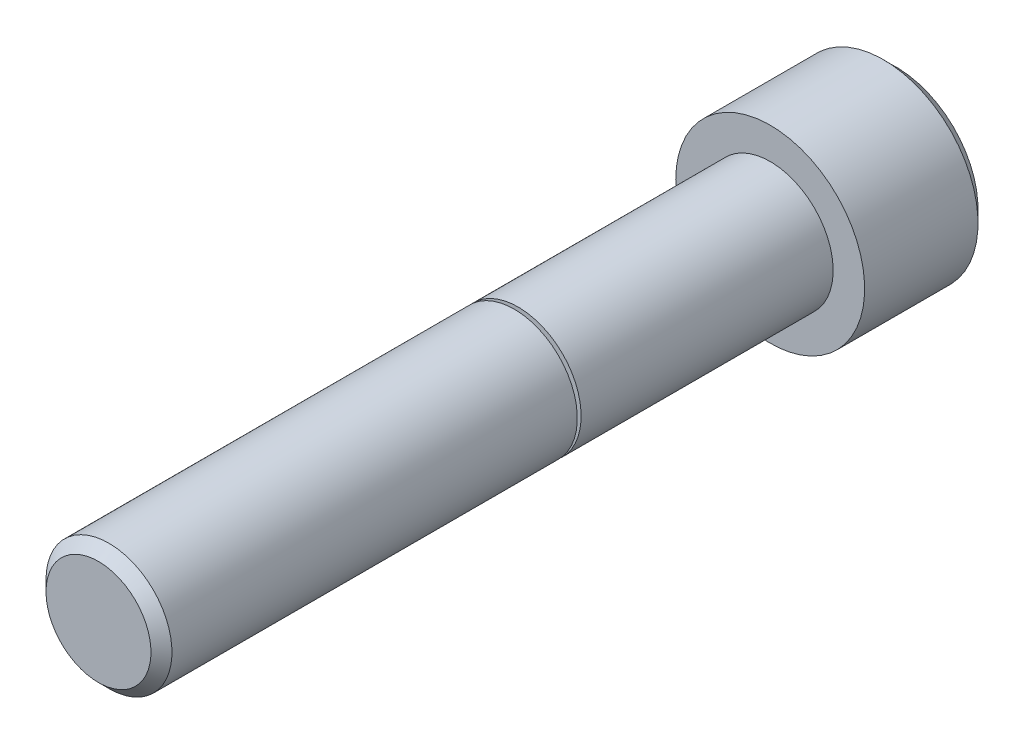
ISO-10303-21;
HEADER;
FILE_DESCRIPTION(('STEP AP214'),'2;1');
FILE_NAME('part.step','',(''),(''),'','','');
FILE_SCHEMA(('AUTOMOTIVE_DESIGN { 1 0 10303 214 1 1 1 1 }'));
ENDSEC;
DATA;
#1=APPLICATION_CONTEXT('core data for automotive mechanical design processes');
#2=APPLICATION_PROTOCOL_DEFINITION('international standard','automotive_design',2000,#1);
#3=PRODUCT_CONTEXT('',#1,'mechanical');
#4=PRODUCT('Part','Part','',(#3));
#5=PRODUCT_RELATED_PRODUCT_CATEGORY('part','',(#4));
#6=PRODUCT_DEFINITION_FORMATION('','',#4);
#7=PRODUCT_DEFINITION_CONTEXT('part definition',#1,'design');
#8=PRODUCT_DEFINITION('design','',#6,#7);
#9=PRODUCT_DEFINITION_SHAPE('','',#8);
#10=(LENGTH_UNIT() NAMED_UNIT(*) SI_UNIT(.MILLI.,.METRE.));
#11=(NAMED_UNIT(*) PLANE_ANGLE_UNIT() SI_UNIT($,.RADIAN.));
#12=(NAMED_UNIT(*) SI_UNIT($,.STERADIAN.) SOLID_ANGLE_UNIT());
#13=UNCERTAINTY_MEASURE_WITH_UNIT(LENGTH_MEASURE(1.E-05),#10,'distance_accuracy_value','');
#14=(GEOMETRIC_REPRESENTATION_CONTEXT(3) GLOBAL_UNCERTAINTY_ASSIGNED_CONTEXT((#13)) GLOBAL_UNIT_ASSIGNED_CONTEXT((#10,
#11,#12)) REPRESENTATION_CONTEXT('',''));
#15=CARTESIAN_POINT('',(0.,0.,0.));
#16=DIRECTION('',(0.,0.,1.));
#17=DIRECTION('',(1.,0.,0.));
#18=AXIS2_PLACEMENT_3D('',#15,#16,#17);
#19=CARTESIAN_POINT('',(0.,0.,-9.52499999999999));
#20=DIRECTION('',(0.,0.,1.));
#21=DIRECTION('',(1.,0.,0.));
#22=AXIS2_PLACEMENT_3D('',#19,#20,#21);
#23=PLANE('',#22);
#24=DIRECTION('',(-0.5,-0.866025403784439,0.));
#25=VECTOR('',#24,1.);
#26=CARTESIAN_POINT('',(4.57538541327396,0.,-9.52499999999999));
#27=LINE('',#26,#25);
#28=CARTESIAN_POINT('',(4.57538541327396,0.,-9.52499999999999));
#29=VERTEX_POINT('',#28);
#30=CARTESIAN_POINT('',(2.28769270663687,-3.96240000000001,-9.52499999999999));
#31=VERTEX_POINT('',#30);
#32=EDGE_CURVE('E145',#29,#31,#27,.T.);
#33=ORIENTED_EDGE('',*,*,#32,.F.);
#34=DIRECTION('',(0.499999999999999,-0.866025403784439,0.));
#35=VECTOR('',#34,1.);
#36=CARTESIAN_POINT('',(2.28769270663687,3.96240000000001,-9.52499999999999));
#37=LINE('',#36,#35);
#38=CARTESIAN_POINT('',(2.28769270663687,3.96240000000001,-9.52499999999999));
#39=VERTEX_POINT('',#38);
#40=EDGE_CURVE('E64',#39,#29,#37,.T.);
#41=ORIENTED_EDGE('',*,*,#40,.F.);
#42=DIRECTION('',(1.,0.,0.));
#43=VECTOR('',#42,1.);
#44=CARTESIAN_POINT('',(-2.28769270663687,3.96240000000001,-9.52499999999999));
#45=LINE('',#44,#43);
#46=CARTESIAN_POINT('',(-2.28769270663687,3.96240000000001,-9.52499999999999));
#47=VERTEX_POINT('',#46);
#48=EDGE_CURVE('E158',#47,#39,#45,.T.);
#49=ORIENTED_EDGE('',*,*,#48,.F.);
#50=DIRECTION('',(0.5,0.866025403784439,0.));
#51=VECTOR('',#50,1.);
#52=CARTESIAN_POINT('',(-4.57538541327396,0.,-9.52499999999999));
#53=LINE('',#52,#51);
#54=CARTESIAN_POINT('',(-4.57538541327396,0.,-9.52499999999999));
#55=VERTEX_POINT('',#54);
#56=EDGE_CURVE('E155',#55,#47,#53,.T.);
#57=ORIENTED_EDGE('',*,*,#56,.F.);
#58=DIRECTION('',(-0.5,0.866025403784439,0.));
#59=VECTOR('',#58,1.);
#60=CARTESIAN_POINT('',(-2.28769270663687,-3.96240000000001,-9.52499999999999));
#61=LINE('',#60,#59);
#62=CARTESIAN_POINT('',(-2.28769270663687,-3.96240000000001,-9.52499999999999));
#63=VERTEX_POINT('',#62);
#64=EDGE_CURVE('E112',#63,#55,#61,.T.);
#65=ORIENTED_EDGE('',*,*,#64,.F.);
#66=DIRECTION('',(-1.,0.,0.));
#67=VECTOR('',#66,1.);
#68=CARTESIAN_POINT('',(2.28769270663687,-3.96240000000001,-9.52499999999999));
#69=LINE('',#68,#67);
#70=EDGE_CURVE('E149',#31,#63,#69,.T.);
#71=ORIENTED_EDGE('',*,*,#70,.F.);
#72=EDGE_LOOP('',(#33,#41,#49,#57,#65,#71));
#73=FACE_BOUND('',#72,.T.);
#74=CARTESIAN_POINT('',(0.,0.,-9.52499999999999));
#75=DIRECTION('',(0.,0.,-1.));
#76=DIRECTION('',(-1.,0.,0.));
#77=AXIS2_PLACEMENT_3D('',#74,#75,#76);
#78=CIRCLE('',#77,6.19125000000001);
#79=CARTESIAN_POINT('',(-6.19125000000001,0.,-9.52499999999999));
#80=VERTEX_POINT('',#79);
#81=EDGE_CURVE('E164',#80,#80,#78,.T.);
#82=ORIENTED_EDGE('',*,*,#81,.T.);
#83=EDGE_LOOP('',(#82));
#84=FACE_BOUND('',#83,.T.);
#85=ADVANCED_FACE('F49',(#73,#84),#23,.F.);
#86=CARTESIAN_POINT('',(-3.96875000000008,0.,50.8));
#87=DIRECTION('',(0.,0.,-1.));
#88=DIRECTION('',(-1.,0.,0.));
#89=AXIS2_PLACEMENT_3D('',#86,#87,#88);
#90=PLANE('',#89);
#91=CARTESIAN_POINT('',(0.,0.,50.8));
#92=DIRECTION('',(0.,0.,-1.));
#93=DIRECTION('',(-1.,0.,0.));
#94=AXIS2_PLACEMENT_3D('',#91,#92,#93);
#95=CIRCLE('',#94,3.96875000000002);
#96=CARTESIAN_POINT('',(-3.96875000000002,0.,50.8));
#97=VERTEX_POINT('',#96);
#98=EDGE_CURVE('E11',#97,#97,#95,.T.);
#99=ORIENTED_EDGE('',*,*,#98,.F.);
#100=EDGE_LOOP('',(#99));
#101=FACE_BOUND('',#100,.T.);
#102=ADVANCED_FACE('F214',(#101),#90,.F.);
#103=CARTESIAN_POINT('',(0.,0.,50.8));
#104=DIRECTION('',(0.,0.,-1.));
#105=DIRECTION('',(-1.,0.,0.));
#106=AXIS2_PLACEMENT_3D('',#103,#104,#105);
#107=CONICAL_SURFACE('',#106,3.96875000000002,0.785398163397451);
#108=CARTESIAN_POINT('',(0.,0.,50.00625));
#109=DIRECTION('',(0.,0.,-1.));
#110=DIRECTION('',(-1.,0.,0.));
#111=AXIS2_PLACEMENT_3D('',#108,#109,#110);
#112=CIRCLE('',#111,4.76250000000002);
#113=CARTESIAN_POINT('',(-4.76250000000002,0.,50.00625));
#114=VERTEX_POINT('',#113);
#115=EDGE_CURVE('E57',#114,#114,#112,.T.);
#116=ORIENTED_EDGE('',*,*,#115,.F.);
#117=EDGE_LOOP('',(#116));
#118=FACE_BOUND('',#117,.T.);
#119=ORIENTED_EDGE('',*,*,#98,.T.);
#120=EDGE_LOOP('',(#119));
#121=FACE_BOUND('',#120,.T.);
#122=ADVANCED_FACE('F211',(#118,#121),#107,.T.);
#123=CARTESIAN_POINT('',(0.,0.,-10.585154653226));
#124=DIRECTION('',(0.,0.,-1.));
#125=DIRECTION('',(-1.,0.,0.));
#126=AXIS2_PLACEMENT_3D('',#123,#124,#125);
#127=CYLINDRICAL_SURFACE('',#126,4.76250000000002);
#128=CARTESIAN_POINT('',(0.,0.,19.3489013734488));
#129=DIRECTION('',(0.,0.,-1.));
#130=DIRECTION('',(-1.,0.,0.));
#131=AXIS2_PLACEMENT_3D('',#128,#129,#130);
#132=CIRCLE('',#131,4.76250000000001);
#133=CARTESIAN_POINT('',(-4.76250000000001,0.,19.3489013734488));
#134=VERTEX_POINT('',#133);
#135=EDGE_CURVE('E201',#134,#134,#132,.T.);
#136=ORIENTED_EDGE('',*,*,#135,.F.);
#137=EDGE_LOOP('',(#136));
#138=FACE_BOUND('',#137,.T.);
#139=ORIENTED_EDGE('',*,*,#115,.T.);
#140=EDGE_LOOP('',(#139));
#141=FACE_BOUND('',#140,.T.);
#142=ADVANCED_FACE('F209',(#138,#141),#127,.T.);
#143=CARTESIAN_POINT('',(0.,0.,19.3489013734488));
#144=DIRECTION('',(0.,0.,1.));
#145=DIRECTION('',(1.,0.,0.));
#146=AXIS2_PLACEMENT_3D('',#143,#144,#145);
#147=CONICAL_SURFACE('',#146,4.76250000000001,1.22173047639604);
#148=CARTESIAN_POINT('',(0.,0.,19.0987938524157));
#149=DIRECTION('',(0.,0.,-1.));
#150=DIRECTION('',(-1.,0.,0.));
#151=AXIS2_PLACEMENT_3D('',#148,#149,#150);
#152=CIRCLE('',#151,4.07533523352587);
#153=CARTESIAN_POINT('',(-4.07533523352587,0.,19.0987938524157));
#154=VERTEX_POINT('',#153);
#155=EDGE_CURVE('E197',#154,#154,#152,.T.);
#156=ORIENTED_EDGE('',*,*,#155,.F.);
#157=EDGE_LOOP('',(#156));
#158=FACE_BOUND('',#157,.T.);
#159=ORIENTED_EDGE('',*,*,#135,.T.);
#160=EDGE_LOOP('',(#159));
#161=FACE_BOUND('',#160,.T.);
#162=ADVANCED_FACE('F226',(#158,#161),#147,.T.);
#163=CARTESIAN_POINT('',(0.,0.,19.08));
#164=DIRECTION('',(0.,0.,-1.));
#165=DIRECTION('',(-1.,0.,0.));
#166=AXIS2_PLACEMENT_3D('',#163,#164,#165);
#167=TOROIDAL_SURFACE('',#166,4.08217563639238,0.0199999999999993);
#168=CARTESIAN_POINT('',(0.,0.,19.06));
#169=DIRECTION('',(0.,0.,-1.));
#170=DIRECTION('',(-1.,0.,0.));
#171=AXIS2_PLACEMENT_3D('',#168,#169,#170);
#172=CIRCLE('',#171,4.08217563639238);
#173=CARTESIAN_POINT('',(-4.08217563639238,0.,19.06));
#174=VERTEX_POINT('',#173);
#175=EDGE_CURVE('E193',#174,#174,#172,.T.);
#176=ORIENTED_EDGE('',*,*,#175,.F.);
#177=EDGE_LOOP('',(#176));
#178=FACE_BOUND('',#177,.T.);
#179=ORIENTED_EDGE('',*,*,#155,.T.);
#180=EDGE_LOOP('',(#179));
#181=FACE_BOUND('',#180,.T.);
#182=ADVANCED_FACE('F230',(#178,#181),#167,.F.);
#183=CARTESIAN_POINT('',(-4.7625,0.,19.06));
#184=DIRECTION('',(0.,0.,-1.));
#185=DIRECTION('',(-1.,0.,0.));
#186=AXIS2_PLACEMENT_3D('',#183,#184,#185);
#187=PLANE('',#186);
#188=CARTESIAN_POINT('',(0.,0.,19.06));
#189=DIRECTION('',(0.,0.,-1.));
#190=DIRECTION('',(-1.,0.,0.));
#191=AXIS2_PLACEMENT_3D('',#188,#189,#190);
#192=CIRCLE('',#191,4.76250000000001);
#193=CARTESIAN_POINT('',(-4.76250000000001,0.,19.06));
#194=VERTEX_POINT('',#193);
#195=EDGE_CURVE('E189',#194,#194,#192,.T.);
#196=ORIENTED_EDGE('',*,*,#195,.F.);
#197=EDGE_LOOP('',(#196));
#198=FACE_BOUND('',#197,.T.);
#199=ORIENTED_EDGE('',*,*,#175,.T.);
#200=EDGE_LOOP('',(#199));
#201=FACE_BOUND('',#200,.T.);
#202=ADVANCED_FACE('F234',(#198,#201),#187,.F.);
#203=CARTESIAN_POINT('',(0.,0.,-10.585154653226));
#204=DIRECTION('',(0.,0.,-1.));
#205=DIRECTION('',(-1.,0.,0.));
#206=AXIS2_PLACEMENT_3D('',#203,#204,#205);
#207=CYLINDRICAL_SURFACE('',#206,4.76250000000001);
#208=CARTESIAN_POINT('',(0.,0.,0.));
#209=DIRECTION('',(0.,0.,-1.));
#210=DIRECTION('',(-1.,0.,0.));
#211=AXIS2_PLACEMENT_3D('',#208,#209,#210);
#212=CIRCLE('',#211,4.7625);
#213=CARTESIAN_POINT('',(-4.7625,0.,0.));
#214=VERTEX_POINT('',#213);
#215=EDGE_CURVE('E185',#214,#214,#212,.T.);
#216=ORIENTED_EDGE('',*,*,#215,.F.);
#217=EDGE_LOOP('',(#216));
#218=FACE_BOUND('',#217,.T.);
#219=ORIENTED_EDGE('',*,*,#195,.T.);
#220=EDGE_LOOP('',(#219));
#221=FACE_BOUND('',#220,.T.);
#222=ADVANCED_FACE('F238',(#218,#221),#207,.T.);
#223=CARTESIAN_POINT('',(-7.14375,0.,0.));
#224=DIRECTION('',(0.,0.,-1.));
#225=DIRECTION('',(-1.,0.,0.));
#226=AXIS2_PLACEMENT_3D('',#223,#224,#225);
#227=PLANE('',#226);
#228=CARTESIAN_POINT('',(0.,0.,0.));
#229=DIRECTION('',(0.,0.,-1.));
#230=DIRECTION('',(-1.,0.,0.));
#231=AXIS2_PLACEMENT_3D('',#228,#229,#230);
#232=CIRCLE('',#231,7.14375000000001);
#233=CARTESIAN_POINT('',(-7.14375000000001,0.,0.));
#234=VERTEX_POINT('',#233);
#235=EDGE_CURVE('E181',#234,#234,#232,.T.);
#236=ORIENTED_EDGE('',*,*,#235,.F.);
#237=EDGE_LOOP('',(#236));
#238=FACE_BOUND('',#237,.T.);
#239=ORIENTED_EDGE('',*,*,#215,.T.);
#240=EDGE_LOOP('',(#239));
#241=FACE_BOUND('',#240,.T.);
#242=ADVANCED_FACE('F242',(#238,#241),#227,.F.);
#243=CARTESIAN_POINT('',(0.,0.,-10.585154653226));
#244=DIRECTION('',(0.,0.,-1.));
#245=DIRECTION('',(-1.,0.,0.));
#246=AXIS2_PLACEMENT_3D('',#243,#244,#245);
#247=CYLINDRICAL_SURFACE('',#246,7.14375);
#248=CARTESIAN_POINT('',(0.,0.,-8.5725));
#249=DIRECTION('',(0.,0.,-1.));
#250=DIRECTION('',(-1.,0.,0.));
#251=AXIS2_PLACEMENT_3D('',#248,#249,#250);
#252=CIRCLE('',#251,7.14375);
#253=CARTESIAN_POINT('',(-7.14375,0.,-8.5725));
#254=VERTEX_POINT('',#253);
#255=EDGE_CURVE('E177',#254,#254,#252,.T.);
#256=ORIENTED_EDGE('',*,*,#255,.F.);
#257=EDGE_LOOP('',(#256));
#258=FACE_BOUND('',#257,.T.);
#259=ORIENTED_EDGE('',*,*,#235,.T.);
#260=EDGE_LOOP('',(#259));
#261=FACE_BOUND('',#260,.T.);
#262=ADVANCED_FACE('F246',(#258,#261),#247,.T.);
#263=CARTESIAN_POINT('',(0.,0.,-8.5725));
#264=DIRECTION('',(0.,0.,1.));
#265=DIRECTION('',(1.,0.,0.));
#266=AXIS2_PLACEMENT_3D('',#263,#264,#265);
#267=CONICAL_SURFACE('',#266,7.14375,0.785398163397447);
#268=ORIENTED_EDGE('',*,*,#81,.F.);
#269=EDGE_LOOP('',(#268));
#270=FACE_BOUND('',#269,.T.);
#271=ORIENTED_EDGE('',*,*,#255,.T.);
#272=EDGE_LOOP('',(#271));
#273=FACE_BOUND('',#272,.T.);
#274=ADVANCED_FACE('F250',(#270,#273),#267,.T.);
#275=CARTESIAN_POINT('',(2.28769270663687,3.96240000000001,-4.7625));
#276=DIRECTION('',(0.866025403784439,0.499999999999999,0.));
#277=DIRECTION('',(-0.499999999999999,0.866025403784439,0.));
#278=AXIS2_PLACEMENT_3D('',#275,#276,#277);
#279=PLANE('',#278);
#280=ORIENTED_EDGE('',*,*,#40,.T.);
#281=DIRECTION('',(0.,0.,-1.));
#282=VECTOR('',#281,1.);
#283=CARTESIAN_POINT('',(4.57538541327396,0.,-4.7625));
#284=LINE('',#283,#282);
#285=CARTESIAN_POINT('',(4.57538541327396,0.,-4.7625));
#286=VERTEX_POINT('',#285);
#287=EDGE_CURVE('E94',#286,#29,#284,.T.);
#288=ORIENTED_EDGE('',*,*,#287,.F.);
#289=DIRECTION('',(0.499999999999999,-0.866025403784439,0.));
#290=VECTOR('',#289,1.);
#291=CARTESIAN_POINT('',(2.28769270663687,3.96240000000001,-4.7625));
#292=LINE('',#291,#290);
#293=CARTESIAN_POINT('',(2.28769270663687,3.96240000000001,-4.7625));
#294=VERTEX_POINT('',#293);
#295=EDGE_CURVE('E161',#294,#286,#292,.T.);
#296=ORIENTED_EDGE('',*,*,#295,.F.);
#297=DIRECTION('',(0.,0.,-1.));
#298=VECTOR('',#297,1.);
#299=CARTESIAN_POINT('',(2.28769270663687,3.96240000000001,-4.7625));
#300=LINE('',#299,#298);
#301=EDGE_CURVE('E72',#294,#39,#300,.T.);
#302=ORIENTED_EDGE('',*,*,#301,.T.);
#303=EDGE_LOOP('',(#280,#288,#296,#302));
#304=FACE_BOUND('',#303,.T.);
#305=ADVANCED_FACE('F254',(#304),#279,.F.);
#306=CARTESIAN_POINT('',(-2.28769270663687,3.96240000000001,-4.7625));
#307=DIRECTION('',(0.,1.,0.));
#308=DIRECTION('',(-1.,0.,0.));
#309=AXIS2_PLACEMENT_3D('',#306,#307,#308);
#310=PLANE('',#309);
#311=ORIENTED_EDGE('',*,*,#48,.T.);
#312=ORIENTED_EDGE('',*,*,#301,.F.);
#313=DIRECTION('',(1.,0.,0.));
#314=VECTOR('',#313,1.);
#315=CARTESIAN_POINT('',(-2.28769270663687,3.96240000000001,-4.7625));
#316=LINE('',#315,#314);
#317=CARTESIAN_POINT('',(-2.28769270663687,3.96240000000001,-4.7625));
#318=VERTEX_POINT('',#317);
#319=EDGE_CURVE('E126',#318,#294,#316,.T.);
#320=ORIENTED_EDGE('',*,*,#319,.F.);
#321=DIRECTION('',(0.,0.,-1.));
#322=VECTOR('',#321,1.);
#323=CARTESIAN_POINT('',(-2.28769270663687,3.96240000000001,-4.7625));
#324=LINE('',#323,#322);
#325=EDGE_CURVE('E117',#318,#47,#324,.T.);
#326=ORIENTED_EDGE('',*,*,#325,.T.);
#327=EDGE_LOOP('',(#311,#312,#320,#326));
#328=FACE_BOUND('',#327,.T.);
#329=ADVANCED_FACE('F258',(#328),#310,.F.);
#330=CARTESIAN_POINT('',(-4.57538541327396,0.,-4.7625));
#331=DIRECTION('',(-0.866025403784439,0.5,0.));
#332=DIRECTION('',(-0.5,-0.866025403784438,0.));
#333=AXIS2_PLACEMENT_3D('',#330,#331,#332);
#334=PLANE('',#333);
#335=ORIENTED_EDGE('',*,*,#56,.T.);
#336=ORIENTED_EDGE('',*,*,#325,.F.);
#337=DIRECTION('',(0.5,0.866025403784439,0.));
#338=VECTOR('',#337,1.);
#339=CARTESIAN_POINT('',(-4.57538541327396,0.,-4.7625));
#340=LINE('',#339,#338);
#341=CARTESIAN_POINT('',(-4.57538541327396,0.,-4.7625));
#342=VERTEX_POINT('',#341);
#343=EDGE_CURVE('E121',#342,#318,#340,.T.);
#344=ORIENTED_EDGE('',*,*,#343,.F.);
#345=DIRECTION('',(0.,0.,-1.));
#346=VECTOR('',#345,1.);
#347=CARTESIAN_POINT('',(-4.57538541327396,0.,-4.7625));
#348=LINE('',#347,#346);
#349=EDGE_CURVE('E105',#342,#55,#348,.T.);
#350=ORIENTED_EDGE('',*,*,#349,.T.);
#351=EDGE_LOOP('',(#335,#336,#344,#350));
#352=FACE_BOUND('',#351,.T.);
#353=ADVANCED_FACE('F122',(#352),#334,.F.);
#354=CARTESIAN_POINT('',(-2.28769270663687,-3.96240000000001,-4.7625));
#355=DIRECTION('',(-0.866025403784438,-0.5,0.));
#356=DIRECTION('',(0.5,-0.866025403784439,0.));
#357=AXIS2_PLACEMENT_3D('',#354,#355,#356);
#358=PLANE('',#357);
#359=ORIENTED_EDGE('',*,*,#64,.T.);
#360=ORIENTED_EDGE('',*,*,#349,.F.);
#361=DIRECTION('',(-0.5,0.866025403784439,0.));
#362=VECTOR('',#361,1.);
#363=CARTESIAN_POINT('',(-2.28769270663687,-3.96240000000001,-4.7625));
#364=LINE('',#363,#362);
#365=CARTESIAN_POINT('',(-2.28769270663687,-3.96240000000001,-4.7625));
#366=VERTEX_POINT('',#365);
#367=EDGE_CURVE('E109',#366,#342,#364,.T.);
#368=ORIENTED_EDGE('',*,*,#367,.F.);
#369=DIRECTION('',(0.,0.,-1.));
#370=VECTOR('',#369,1.);
#371=CARTESIAN_POINT('',(-2.28769270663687,-3.96240000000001,-4.7625));
#372=LINE('',#371,#370);
#373=EDGE_CURVE('E118',#366,#63,#372,.T.);
#374=ORIENTED_EDGE('',*,*,#373,.T.);
#375=EDGE_LOOP('',(#359,#360,#368,#374));
#376=FACE_BOUND('',#375,.T.);
#377=ADVANCED_FACE('F107',(#376),#358,.F.);
#378=CARTESIAN_POINT('',(2.28769270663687,-3.96240000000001,-4.7625));
#379=DIRECTION('',(0.,-1.,0.));
#380=DIRECTION('',(0.,0.,-1.));
#381=AXIS2_PLACEMENT_3D('',#378,#379,#380);
#382=PLANE('',#381);
#383=ORIENTED_EDGE('',*,*,#70,.T.);
#384=ORIENTED_EDGE('',*,*,#373,.F.);
#385=DIRECTION('',(-1.,0.,0.));
#386=VECTOR('',#385,1.);
#387=CARTESIAN_POINT('',(2.28769270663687,-3.96240000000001,-4.7625));
#388=LINE('',#387,#386);
#389=CARTESIAN_POINT('',(2.28769270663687,-3.96240000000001,-4.7625));
#390=VERTEX_POINT('',#389);
#391=EDGE_CURVE('E132',#390,#366,#388,.T.);
#392=ORIENTED_EDGE('',*,*,#391,.F.);
#393=DIRECTION('',(0.,0.,-1.));
#394=VECTOR('',#393,1.);
#395=CARTESIAN_POINT('',(2.28769270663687,-3.96240000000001,-4.7625));
#396=LINE('',#395,#394);
#397=EDGE_CURVE('E169',#390,#31,#396,.T.);
#398=ORIENTED_EDGE('',*,*,#397,.T.);
#399=EDGE_LOOP('',(#383,#384,#392,#398));
#400=FACE_BOUND('',#399,.T.);
#401=ADVANCED_FACE('F262',(#400),#382,.F.);
#402=CARTESIAN_POINT('',(4.57538541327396,0.,-4.7625));
#403=DIRECTION('',(0.866025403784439,-0.5,0.));
#404=DIRECTION('',(0.5,0.866025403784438,0.));
#405=AXIS2_PLACEMENT_3D('',#402,#403,#404);
#406=PLANE('',#405);
#407=ORIENTED_EDGE('',*,*,#32,.T.);
#408=ORIENTED_EDGE('',*,*,#397,.F.);
#409=DIRECTION('',(-0.5,-0.866025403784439,0.));
#410=VECTOR('',#409,1.);
#411=CARTESIAN_POINT('',(4.57538541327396,0.,-4.7625));
#412=LINE('',#411,#410);
#413=EDGE_CURVE('E137',#286,#390,#412,.T.);
#414=ORIENTED_EDGE('',*,*,#413,.F.);
#415=ORIENTED_EDGE('',*,*,#287,.T.);
#416=EDGE_LOOP('',(#407,#408,#414,#415));
#417=FACE_BOUND('',#416,.T.);
#418=ADVANCED_FACE('F259',(#417),#406,.F.);
#419=CARTESIAN_POINT('',(2.28769270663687,3.96240000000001,-4.7625));
#420=DIRECTION('',(0.,0.,1.));
#421=DIRECTION('',(1.,0.,0.));
#422=AXIS2_PLACEMENT_3D('',#419,#420,#421);
#423=PLANE('',#422);
#424=ORIENTED_EDGE('',*,*,#295,.T.);
#425=ORIENTED_EDGE('',*,*,#413,.T.);
#426=ORIENTED_EDGE('',*,*,#391,.T.);
#427=ORIENTED_EDGE('',*,*,#367,.T.);
#428=ORIENTED_EDGE('',*,*,#343,.T.);
#429=ORIENTED_EDGE('',*,*,#319,.T.);
#430=EDGE_LOOP('',(#424,#425,#426,#427,#428,#429));
#431=FACE_BOUND('',#430,.T.);
#432=ADVANCED_FACE('F129',(#431),#423,.F.);
#433=CLOSED_SHELL('',(#85,#102,#122,#142,#162,#182,#202,#222,#242,#262,#274,#305,#329,#353,#377,
#401,#418,#432));
#434=MANIFOLD_SOLID_BREP('B2',#433);
#435=ADVANCED_BREP_SHAPE_REPRESENTATION('',(#18,#434),#14);
#436=SHAPE_DEFINITION_REPRESENTATION(#9,#435);
ENDSEC;
END-ISO-10303-21;
